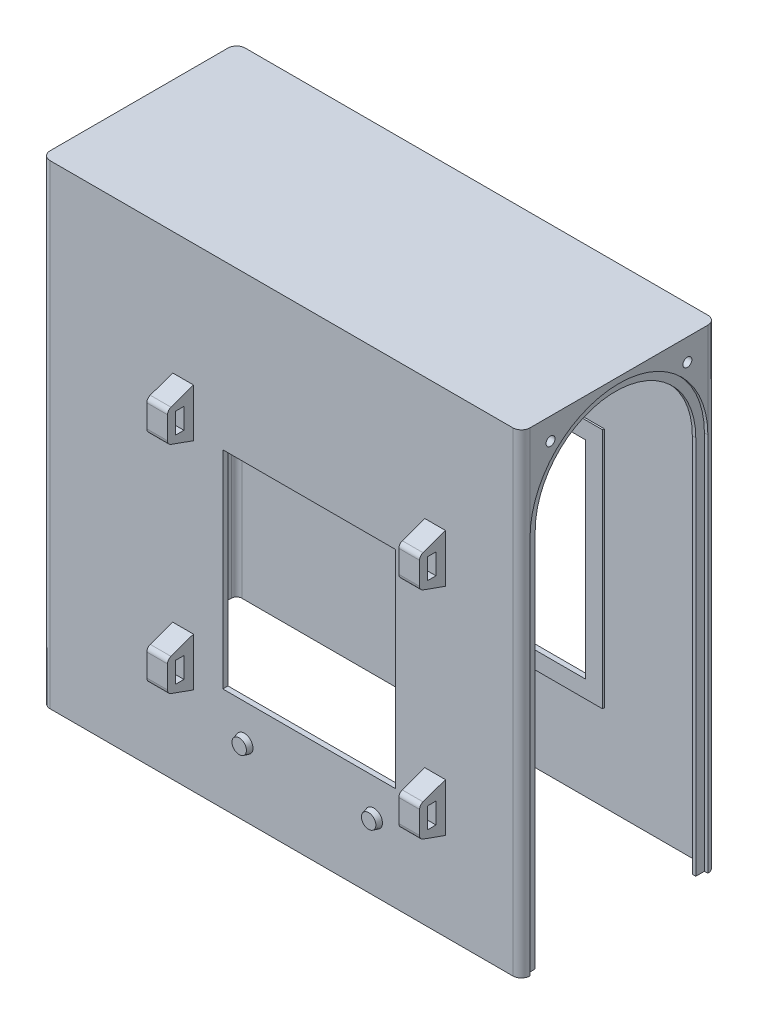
from build123d import *

# Parameters (mm, degrees)
BOSS_EXTRU_1_DEPTH      = 275
ENL_V_MAT_EXTRU_3_DEPTH = 273.5
CADRECOT_DEPTH          = 2
ENL_V_MAT_EXTRU_1_REACH = 395.692
ESQUISSE3_W             = 100
ESQUISSE3_H             = 120
CADREECLAIRAGE_DEPTH    = 329.199634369
ESQUISSE5_W             = 120
ESQUISSE5_H             = 140
ESQUISSE5_W_2           = 100
ESQUISSE5_H_2           = 120
BOSSCADREAV_DEPTH       = 3
TROUVERROU_REACH        = 417.85
ESQUISSE6_R             = 2.6
ESQUISSE13_W            = 12
ESQUISSE13_H            = 28
BOSSFIXPROJ_DEPTH       = 15
ESQUISSE14_W            = 5
ESQUISSE14_H            = 12
TROUFIXPROJ_DEPTH       = 349.627666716
ESQUISSE9_R             = 5
PIONPROJECTEUR_DEPTH    = 3
CONG_1_R                = 3
CONG_1_OF_SYM_TRIE1_R   = 3
D_POUILLEAV_ANGLE       = 15
D_POUILLEAR_ANGLE       = 15


with BuildPart() as part:
    # Esquisse1 → Boss.-Extru.1 (new body)
    with BuildSketch(Plane(origin=(0, 0, 0), x_dir=(1, 0, 0), z_dir=(0, 1, 0))):
        with BuildLine():
            Line((-134, 56.5), (134, 56.5))
            ThreePointArc((134, 56.5), (137.535533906, 55.035533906), (139, 51.5))
            Line((139, 51.5), (139, -51.5))
            ThreePointArc((139, -51.5), (137.535533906, -55.035533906), (134, -56.5))
            Line((134, -56.5), (-134, -56.5))
            ThreePointArc((-134, -56.5), (-137.535533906, -55.035533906), (-139, -51.5))
            Line((-139, -51.5), (-139, 51.5))
            ThreePointArc((-139, 51.5), (-137.535533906, 55.035533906), (-134, 56.5))
        make_face()
    extrude(amount=BOSS_EXTRU_1_DEPTH)

    # Esquisse16 → Enl_v. mat.-Extru.3 (cut)
    with BuildSketch(Plane.XZ):
        with BuildLine():
            Line((-134, -54.5), (131.5, -54.5))
            ThreePointArc((131.5, -54.5), (133.974873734, -53.474873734), (135, -51))
            Line((135, -51), (135, 51))
            ThreePointArc((135, 51), (133.974873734, 53.474873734), (131.5, 54.5))
            Line((131.5, 54.5), (-134, 54.5))
            ThreePointArc((-134, 54.5), (-136.121320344, 53.621320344), (-137, 51.5))
            Line((-137, 51.5), (-137, -51.5))
            ThreePointArc((-137, -51.5), (-136.121320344, -53.621320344), (-134, -54.5))
        make_face()
    extrude(amount=-ENL_V_MAT_EXTRU_3_DEPTH, mode=Mode.SUBTRACT)

    # Esquisse4 → CadreCot (cut)
    with BuildSketch(Plane(origin=(139, 0, -85), x_dir=(0, 0, 1), z_dir=(-1, 0, 0))):
        with BuildLine():
            Line((33.5, 220), (33.5, 0))
            Line((33.5, 0), (136.5, 0))
            Line((136.5, 0), (136.5, 220))
            ThreePointArc((136.5, 220), (85, 271.5), (33.5, 220))
        make_face()
    extrude(amount=CADRECOT_DEPTH, mode=Mode.SUBTRACT)

    # Esquisse15 → Enl_v. mat.-Extru.1 (cut, up to next)
    with BuildSketch(Plane(origin=(137, 0, 0), x_dir=(0, 0, -1), z_dir=(1, 0, 0)), mode=Mode.PRIVATE) as enl_v_mat_extru_1_sk1:
        with BuildLine():
            Line((-46.5, 0), (46.5, 0))
            Line((46.5, 0), (46.5, 220))
            ThreePointArc((46.5, 220), (0, 266.5), (-46.5, 220))
            Line((-46.5, 220), (-46.5, 0))
        make_face()
    enl_v_mat_extru_1_tool1 = extrude(enl_v_mat_extru_1_sk1.sketch, amount=-ENL_V_MAT_EXTRU_1_REACH, mode=Mode.PRIVATE) & part.part
    add(enl_v_mat_extru_1_tool1.solids().sort_by_distance((137, 128.470462, 0))[0], mode=Mode.SUBTRACT)

    # Esquisse3 → CadreEclairage (cut, through all)
    with BuildSketch(Plane.XY.offset(56.5)):
        with Locations((16, 120)):
            Rectangle(ESQUISSE3_W, ESQUISSE3_H)
    extrude(amount=-CADREECLAIRAGE_DEPTH, mode=Mode.SUBTRACT)

    # Esquisse5 → BossCadreAV (add)
    with BuildSketch(Plane(origin=(0, 0, 56.5), x_dir=(-1, 0, 0), z_dir=(0, 0, -1))):
        with Locations((-16, 120)):
            Rectangle(ESQUISSE5_W, ESQUISSE5_H)
        with Locations((-16, 120)):
            Rectangle(ESQUISSE5_W_2, ESQUISSE5_H_2, mode=Mode.SUBTRACT)
    bosscadreav = extrude(amount=BOSSCADREAV_DEPTH)

    # Sym_trie2: BossCadreAV across plane
    add(bosscadreav.mirror(Plane.XY))

    # Esquisse6 → TrouVerrou (cut, up to next)
    with BuildSketch(Plane(origin=(139, 0, -85), x_dir=(0, 0, 1), z_dir=(-1, 0, 0)), mode=Mode.PRIVATE) as trouverrou_sk1:
        with Locations(Location((45.357027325, 262.337155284, 0), (0, 0, 180))):
            Circle(ESQUISSE6_R)
    trouverrou_tool1 = extrude(trouverrou_sk1.sketch, amount=TROUVERROU_REACH, mode=Mode.PRIVATE) & part.part
    # Esquisse6 → TrouVerrou (cut, up to next)
    with BuildSketch(Plane(origin=(139, 0, -85), x_dir=(0, 0, 1), z_dir=(-1, 0, 0)), mode=Mode.PRIVATE) as trouverrou_sk2:
        with Locations(Location((124.642972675, 262.337155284, 0), (0, 0, 180))):
            Circle(ESQUISSE6_R)
    trouverrou_tool2 = extrude(trouverrou_sk2.sketch, amount=TROUVERROU_REACH, mode=Mode.PRIVATE) & part.part
    add(trouverrou_tool1.solids().sort_by_distance((139, 262.337155, -39.642973))[0], mode=Mode.SUBTRACT)
    add(trouverrou_tool2.solids().sort_by_distance((139, 262.337155, 39.642973))[0], mode=Mode.SUBTRACT)

    # Esquisse13 → BossFixProj (add)
    with BuildSketch(Plane.XY.offset(56.5)):
        with Locations((89, 190)):
            Rectangle(ESQUISSE13_W, ESQUISSE13_H)
        with Locations((89, 65)):
            Rectangle(ESQUISSE13_W, ESQUISSE13_H)
        with Locations((-57, 65)):
            Rectangle(ESQUISSE13_W, ESQUISSE13_H)
        with Locations((-57, 190)):
            Rectangle(ESQUISSE13_W, ESQUISSE13_H)
    bossfixproj = extrude(amount=BOSSFIXPROJ_DEPTH)

    # Esquisse14 → TrouFixProj (cut, through all)
    with BuildSketch(Plane.ZY.offset(63)):
        with Locations((64.5, 65)):
            Rectangle(ESQUISSE14_W, ESQUISSE14_H)
        with Locations((64.5, 190)):
            Rectangle(ESQUISSE14_W, ESQUISSE14_H)
        Polygon((56.5, 79), (71.5, 73.639625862), (71.5, 79), align=None)
        Polygon((56.5, 51), (71.5, 56.360374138), (71.5, 51), align=None)
        Polygon((56.5, 204), (71.5, 198.639625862), (71.5, 204), align=None)
        Polygon((56.5, 176), (71.5, 181.360374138), (71.5, 176), align=None)
    troufixproj = extrude(amount=-TROUFIXPROJ_DEPTH, mode=Mode.SUBTRACT)

    # Esquisse9 → PionProjecteur (add)
    with BuildSketch(Plane.XY.offset(56.5)):
        with Locations(Location((-21.5, 39, 0), (0, 0, 180))):
            Circle(ESQUISSE9_R)
        with Locations(Location((53.5, 39, 0), (0, 0, 180))):
            Circle(ESQUISSE9_R)
    pionprojecteur = extrude(amount=PIONPROJECTEUR_DEPTH)

    # Cong_1
    cong_1_edges = [part.edges().sort_by_distance(p)[0] for p in [
        (-57, 181.360374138, 71.5),
        (-57, 198.639625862, 71.5),
        (-57, 73.639625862, 71.5),
        (-57, 56.360374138, 71.5),
        (89, 198.639625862, 71.5),
        (89, 181.360374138, 71.5),
        (89, 56.360374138, 71.5),
        (89, 73.639625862, 71.5),
    ]]
    fillet(cong_1_edges, radius=CONG_1_R)

    # Sym_trie1: BossFixProj, TrouFixProj, PionProjecteur across plane
    add(bossfixproj.mirror(Plane.XY))
    add(troufixproj.mirror(Plane.XY), mode=Mode.SUBTRACT)
    add(pionprojecteur.mirror(Plane.XY))

    # Cong_1 of Sym_trie1
    cong_1_of_sym_trie1_edges = [part.edges().sort_by_distance(p)[0] for p in [
        (-57, 181.360374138, -71.5),
        (-57, 198.639625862, -71.5),
        (-57, 73.639625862, -71.5),
        (-57, 56.360374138, -71.5),
        (89, 198.639625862, -71.5),
        (89, 181.360374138, -71.5),
        (89, 56.360374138, -71.5),
        (89, 73.639625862, -71.5),
    ]]
    fillet(cong_1_of_sym_trie1_edges, radius=CONG_1_OF_SYM_TRIE1_R)

    # D_pouilleAV
    d_pouilleav_faces = [part.faces().sort_by_distance(p)[0] for p in [
        (58.5, 39, 58),
        (-16.5, 39, 58),
    ]]
    draft(d_pouilleav_faces, Plane(origin=(-134, 275, 56.5), x_dir=(1, 0, 0), z_dir=(0, 0, 1)), D_POUILLEAV_ANGLE)

    # D_pouilleAR
    d_pouillear_faces = [part.faces().sort_by_distance(p)[0] for p in [
        (-16.5, 39, -58),
        (58.5, 39, -58),
    ]]
    draft(d_pouillear_faces, Plane(origin=(-134, 275, -56.5), x_dir=(-1, 0, 0), z_dir=(0, 0, -1)), D_POUILLEAR_ANGLE)


solid = part.part
